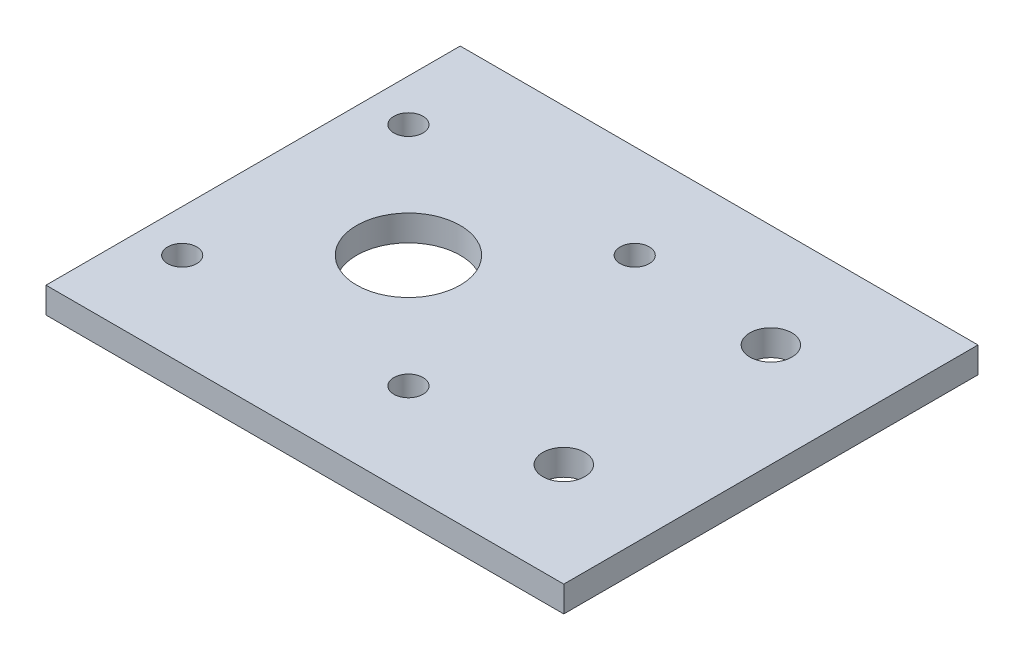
from build123d import *

# Parameters (mm, degrees)
SKETCH5_W          = 254
SKETCH5_H          = 203.2
EXTRUDE1_DEPTH     = 12.7
SKETCH6_R          = 10.31875
CUT_EXTRUDE1_DEPTH = 12.7
SKETCH7_R          = 10.31875
CUT_EXTRUDE3_DEPTH = 12.7
SKETCH8_R          = 25.4
CUT_EXTRUDE4_DEPTH = 12.7
SKETCH10_R         = 7.14375
CUT_EXTRUDE5_DEPTH = 12.7
SKETCH11_R         = 7.14375
CUT_EXTRUDE6_DEPTH = 12.7


with BuildPart() as part:
    # Sketch5 → Extrude1 (new body)
    with BuildSketch(Plane(origin=(0, 0, 0), x_dir=(1, 0, 0), z_dir=(0, 1, 0))):
        with Locations((-127, -101.6)):
            Rectangle(SKETCH5_W, SKETCH5_H)
    extrude(amount=EXTRUDE1_DEPTH)

    # Sketch6 → Cut-Extrude1 (cut)
    with BuildSketch(Plane(origin=(0, 12.7, 0), x_dir=(1, 0, 0), z_dir=(0, 1, 0))):
        with Locations(Location((-50.8, -50.8, 0), (0, 0, 270))):
            Circle(SKETCH6_R)
    extrude(amount=-CUT_EXTRUDE1_DEPTH, mode=Mode.SUBTRACT)

    # Sketch7 → Cut-Extrude3 (cut)
    with BuildSketch(Plane(origin=(0, 12.7, 0), x_dir=(1, 0, 0), z_dir=(0, 1, 0))):
        with Locations(Location((-50.8, -152.4, 0), (0, 0, 270))):
            Circle(SKETCH7_R)
    extrude(amount=-CUT_EXTRUDE3_DEPTH, mode=Mode.SUBTRACT)

    # Sketch8 → Cut-Extrude4 (cut)
    with BuildSketch(Plane(origin=(0, 12.7, 0), x_dir=(1, 0, 0), z_dir=(0, 1, 0))):
        with Locations(Location((-177.8, -101.6, 0), (0, 0, 270))):
            Circle(SKETCH8_R)
    extrude(amount=-CUT_EXTRUDE4_DEPTH, mode=Mode.SUBTRACT)

    # Sketch10 → Cut-Extrude5 (cut)
    with BuildSketch(Plane(origin=(0, 12.7, 0), x_dir=(1, 0, 0), z_dir=(0, 1, 0))):
        with Locations(Location((-122.301, -46.101, 0), (0, 0, 270))):
            Circle(SKETCH10_R)
    cut_extrude5 = extrude(amount=-CUT_EXTRUDE5_DEPTH, mode=Mode.SUBTRACT)

    # Sketch11 → Cut-Extrude6 (cut)
    with BuildSketch(Plane(origin=(0, 12.7, 0), x_dir=(1, 0, 0), z_dir=(0, 1, 0))):
        with Locations(Location((-122.301, -157.099, 0), (0, 0, 270))):
            Circle(SKETCH11_R)
    cut_extrude6 = extrude(amount=-CUT_EXTRUDE6_DEPTH, mode=Mode.SUBTRACT)

    # Mirror1: Cut-Extrude5, Cut-Extrude6 across plane
    add(cut_extrude5.mirror(Plane(origin=(-177.8, 0, 0), x_dir=(0, 0, 1), z_dir=(1, 0, 0))), mode=Mode.SUBTRACT)
    add(cut_extrude6.mirror(Plane(origin=(-177.8, 0, 0), x_dir=(0, 0, 1), z_dir=(1, 0, 0))), mode=Mode.SUBTRACT)


solid = part.part
